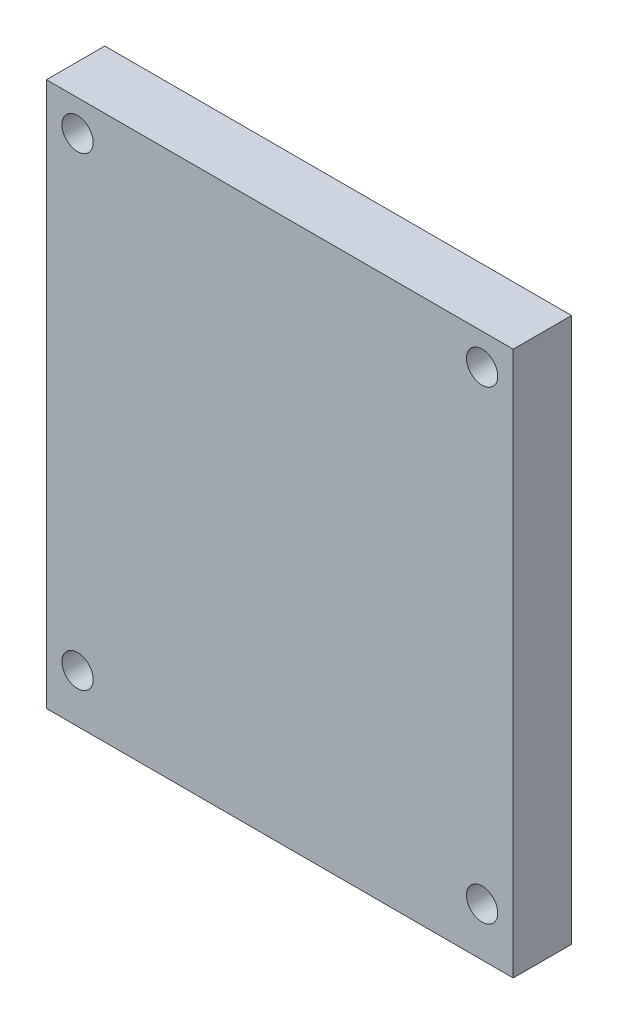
ISO-10303-21;
HEADER;
FILE_DESCRIPTION(('STEP AP214'),'2;1');
FILE_NAME('part.step','',(''),(''),'','','');
FILE_SCHEMA(('AUTOMOTIVE_DESIGN { 1 0 10303 214 1 1 1 1 }'));
ENDSEC;
DATA;
#1=APPLICATION_CONTEXT('core data for automotive mechanical design processes');
#2=APPLICATION_PROTOCOL_DEFINITION('international standard','automotive_design',2000,#1);
#3=PRODUCT_CONTEXT('',#1,'mechanical');
#4=PRODUCT('Part','Part','',(#3));
#5=PRODUCT_RELATED_PRODUCT_CATEGORY('part','',(#4));
#6=PRODUCT_DEFINITION_FORMATION('','',#4);
#7=PRODUCT_DEFINITION_CONTEXT('part definition',#1,'design');
#8=PRODUCT_DEFINITION('design','',#6,#7);
#9=PRODUCT_DEFINITION_SHAPE('','',#8);
#10=(LENGTH_UNIT() NAMED_UNIT(*) SI_UNIT(.MILLI.,.METRE.));
#11=(NAMED_UNIT(*) PLANE_ANGLE_UNIT() SI_UNIT($,.RADIAN.));
#12=(NAMED_UNIT(*) SI_UNIT($,.STERADIAN.) SOLID_ANGLE_UNIT());
#13=UNCERTAINTY_MEASURE_WITH_UNIT(LENGTH_MEASURE(1.E-05),#10,'distance_accuracy_value','');
#14=(GEOMETRIC_REPRESENTATION_CONTEXT(3) GLOBAL_UNCERTAINTY_ASSIGNED_CONTEXT((#13)) GLOBAL_UNIT_ASSIGNED_CONTEXT((#10,
#11,#12)) REPRESENTATION_CONTEXT('',''));
#15=CARTESIAN_POINT('',(0.,0.,0.));
#16=DIRECTION('',(0.,0.,1.));
#17=DIRECTION('',(1.,0.,0.));
#18=AXIS2_PLACEMENT_3D('',#15,#16,#17);
#19=CARTESIAN_POINT('',(0.,0.,9.525));
#20=DIRECTION('',(1.,0.,0.));
#21=DIRECTION('',(0.,0.,-1.));
#22=AXIS2_PLACEMENT_3D('',#19,#20,#21);
#23=PLANE('',#22);
#24=DIRECTION('',(0.,-1.,0.));
#25=VECTOR('',#24,1.);
#26=CARTESIAN_POINT('',(0.,0.,0.));
#27=LINE('',#26,#25);
#28=CARTESIAN_POINT('',(0.,88.9,0.));
#29=VERTEX_POINT('',#28);
#30=CARTESIAN_POINT('',(0.,0.,0.));
#31=VERTEX_POINT('',#30);
#32=EDGE_CURVE('E98',#29,#31,#27,.T.);
#33=ORIENTED_EDGE('',*,*,#32,.T.);
#34=DIRECTION('',(0.,0.,-1.));
#35=VECTOR('',#34,1.);
#36=CARTESIAN_POINT('',(0.,0.,9.525));
#37=LINE('',#36,#35);
#38=CARTESIAN_POINT('',(0.,0.,9.525));
#39=VERTEX_POINT('',#38);
#40=EDGE_CURVE('E11',#39,#31,#37,.T.);
#41=ORIENTED_EDGE('',*,*,#40,.F.);
#42=DIRECTION('',(0.,-1.,0.));
#43=VECTOR('',#42,1.);
#44=CARTESIAN_POINT('',(0.,0.,9.525));
#45=LINE('',#44,#43);
#46=CARTESIAN_POINT('',(0.,88.9,9.525));
#47=VERTEX_POINT('',#46);
#48=EDGE_CURVE('E85',#47,#39,#45,.T.);
#49=ORIENTED_EDGE('',*,*,#48,.F.);
#50=DIRECTION('',(0.,0.,-1.));
#51=VECTOR('',#50,1.);
#52=CARTESIAN_POINT('',(0.,88.9,9.525));
#53=LINE('',#52,#51);
#54=EDGE_CURVE('E94',#47,#29,#53,.T.);
#55=ORIENTED_EDGE('',*,*,#54,.T.);
#56=EDGE_LOOP('',(#33,#41,#49,#55));
#57=FACE_BOUND('',#56,.T.);
#58=ADVANCED_FACE('F32',(#57),#23,.F.);
#59=CARTESIAN_POINT('',(0.,0.,9.525));
#60=DIRECTION('',(0.,1.,0.));
#61=DIRECTION('',(0.,0.,1.));
#62=AXIS2_PLACEMENT_3D('',#59,#60,#61);
#63=PLANE('',#62);
#64=DIRECTION('',(1.,0.,0.));
#65=VECTOR('',#64,1.);
#66=CARTESIAN_POINT('',(0.,0.,0.));
#67=LINE('',#66,#65);
#68=CARTESIAN_POINT('',(76.2,0.,0.));
#69=VERTEX_POINT('',#68);
#70=EDGE_CURVE('E89',#31,#69,#67,.T.);
#71=ORIENTED_EDGE('',*,*,#70,.T.);
#72=DIRECTION('',(0.,0.,-1.));
#73=VECTOR('',#72,1.);
#74=CARTESIAN_POINT('',(76.2,0.,9.525));
#75=LINE('',#74,#73);
#76=CARTESIAN_POINT('',(76.2,0.,9.525));
#77=VERTEX_POINT('',#76);
#78=EDGE_CURVE('E41',#77,#69,#75,.T.);
#79=ORIENTED_EDGE('',*,*,#78,.F.);
#80=DIRECTION('',(1.,0.,0.));
#81=VECTOR('',#80,1.);
#82=CARTESIAN_POINT('',(0.,0.,9.525));
#83=LINE('',#82,#81);
#84=EDGE_CURVE('E80',#39,#77,#83,.T.);
#85=ORIENTED_EDGE('',*,*,#84,.F.);
#86=ORIENTED_EDGE('',*,*,#40,.T.);
#87=EDGE_LOOP('',(#71,#79,#85,#86));
#88=FACE_BOUND('',#87,.T.);
#89=ADVANCED_FACE('F88',(#88),#63,.F.);
#90=CARTESIAN_POINT('',(76.2,0.,9.525));
#91=DIRECTION('',(-1.,0.,0.));
#92=DIRECTION('',(0.,0.,1.));
#93=AXIS2_PLACEMENT_3D('',#90,#91,#92);
#94=PLANE('',#93);
#95=DIRECTION('',(0.,1.,0.));
#96=VECTOR('',#95,1.);
#97=CARTESIAN_POINT('',(76.2,0.,0.));
#98=LINE('',#97,#96);
#99=CARTESIAN_POINT('',(76.2,88.9,0.));
#100=VERTEX_POINT('',#99);
#101=EDGE_CURVE('E67',#69,#100,#98,.T.);
#102=ORIENTED_EDGE('',*,*,#101,.T.);
#103=DIRECTION('',(0.,0.,-1.));
#104=VECTOR('',#103,1.);
#105=CARTESIAN_POINT('',(76.2,88.9,9.525));
#106=LINE('',#105,#104);
#107=CARTESIAN_POINT('',(76.2,88.9,9.525));
#108=VERTEX_POINT('',#107);
#109=EDGE_CURVE('E90',#108,#100,#106,.T.);
#110=ORIENTED_EDGE('',*,*,#109,.F.);
#111=DIRECTION('',(0.,1.,0.));
#112=VECTOR('',#111,1.);
#113=CARTESIAN_POINT('',(76.2,0.,9.525));
#114=LINE('',#113,#112);
#115=EDGE_CURVE('E83',#77,#108,#114,.T.);
#116=ORIENTED_EDGE('',*,*,#115,.F.);
#117=ORIENTED_EDGE('',*,*,#78,.T.);
#118=EDGE_LOOP('',(#102,#110,#116,#117));
#119=FACE_BOUND('',#118,.T.);
#120=ADVANCED_FACE('F92',(#119),#94,.F.);
#121=CARTESIAN_POINT('',(0.,88.9,9.525));
#122=DIRECTION('',(0.,-1.,0.));
#123=DIRECTION('',(0.,0.,-1.));
#124=AXIS2_PLACEMENT_3D('',#121,#122,#123);
#125=PLANE('',#124);
#126=DIRECTION('',(-1.,0.,0.));
#127=VECTOR('',#126,1.);
#128=CARTESIAN_POINT('',(0.,88.9,0.));
#129=LINE('',#128,#127);
#130=EDGE_CURVE('E73',#100,#29,#129,.T.);
#131=ORIENTED_EDGE('',*,*,#130,.T.);
#132=ORIENTED_EDGE('',*,*,#54,.F.);
#133=DIRECTION('',(-1.,0.,0.));
#134=VECTOR('',#133,1.);
#135=CARTESIAN_POINT('',(0.,88.9,9.525));
#136=LINE('',#135,#134);
#137=EDGE_CURVE('E50',#108,#47,#136,.T.);
#138=ORIENTED_EDGE('',*,*,#137,.F.);
#139=ORIENTED_EDGE('',*,*,#109,.T.);
#140=EDGE_LOOP('',(#131,#132,#138,#139));
#141=FACE_BOUND('',#140,.T.);
#142=ADVANCED_FACE('F141',(#141),#125,.F.);
#143=CARTESIAN_POINT('',(0.,0.,9.525));
#144=DIRECTION('',(0.,0.,-1.));
#145=DIRECTION('',(-1.,0.,0.));
#146=AXIS2_PLACEMENT_3D('',#143,#144,#145);
#147=PLANE('',#146);
#148=CARTESIAN_POINT('',(71.12,83.82,9.525));
#149=DIRECTION('',(0.,0.,1.));
#150=DIRECTION('',(1.,0.,0.));
#151=AXIS2_PLACEMENT_3D('',#148,#149,#150);
#152=CIRCLE('',#151,2.55270000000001);
#153=CARTESIAN_POINT('',(73.6727,83.82,9.525));
#154=VERTEX_POINT('',#153);
#155=EDGE_CURVE('E123',#154,#154,#152,.T.);
#156=ORIENTED_EDGE('',*,*,#155,.F.);
#157=EDGE_LOOP('',(#156));
#158=FACE_BOUND('',#157,.T.);
#159=CARTESIAN_POINT('',(5.08,83.82,9.525));
#160=DIRECTION('',(0.,0.,1.));
#161=DIRECTION('',(1.,0.,0.));
#162=AXIS2_PLACEMENT_3D('',#159,#160,#161);
#163=CIRCLE('',#162,2.5527);
#164=CARTESIAN_POINT('',(7.6327,83.82,9.525));
#165=VERTEX_POINT('',#164);
#166=EDGE_CURVE('E113',#165,#165,#163,.T.);
#167=ORIENTED_EDGE('',*,*,#166,.F.);
#168=EDGE_LOOP('',(#167));
#169=FACE_BOUND('',#168,.T.);
#170=CARTESIAN_POINT('',(5.08,7.91210000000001,9.525));
#171=DIRECTION('',(0.,0.,1.));
#172=DIRECTION('',(1.,0.,0.));
#173=AXIS2_PLACEMENT_3D('',#170,#171,#172);
#174=CIRCLE('',#173,2.5527);
#175=CARTESIAN_POINT('',(7.6327,7.91210000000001,9.525));
#176=VERTEX_POINT('',#175);
#177=EDGE_CURVE('E110',#176,#176,#174,.T.);
#178=ORIENTED_EDGE('',*,*,#177,.F.);
#179=EDGE_LOOP('',(#178));
#180=FACE_BOUND('',#179,.T.);
#181=CARTESIAN_POINT('',(71.12,7.91210000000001,9.525));
#182=DIRECTION('',(0.,0.,1.));
#183=DIRECTION('',(1.,0.,0.));
#184=AXIS2_PLACEMENT_3D('',#181,#182,#183);
#185=CIRCLE('',#184,2.55270000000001);
#186=CARTESIAN_POINT('',(73.6727,7.91210000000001,9.525));
#187=VERTEX_POINT('',#186);
#188=EDGE_CURVE('E109',#187,#187,#185,.T.);
#189=ORIENTED_EDGE('',*,*,#188,.F.);
#190=EDGE_LOOP('',(#189));
#191=FACE_BOUND('',#190,.T.);
#192=ORIENTED_EDGE('',*,*,#48,.T.);
#193=ORIENTED_EDGE('',*,*,#84,.T.);
#194=ORIENTED_EDGE('',*,*,#115,.T.);
#195=ORIENTED_EDGE('',*,*,#137,.T.);
#196=EDGE_LOOP('',(#192,#193,#194,#195));
#197=FACE_BOUND('',#196,.T.);
#198=ADVANCED_FACE('F81',(#158,#169,#180,#191,#197),#147,.F.);
#199=CARTESIAN_POINT('',(0.,0.,0.));
#200=DIRECTION('',(0.,0.,-1.));
#201=DIRECTION('',(-1.,0.,0.));
#202=AXIS2_PLACEMENT_3D('',#199,#200,#201);
#203=PLANE('',#202);
#204=CARTESIAN_POINT('',(71.12,83.82,0.));
#205=DIRECTION('',(0.,0.,-1.));
#206=DIRECTION('',(-1.,0.,0.));
#207=AXIS2_PLACEMENT_3D('',#204,#205,#206);
#208=CIRCLE('',#207,2.5527);
#209=CARTESIAN_POINT('',(68.5673,83.82,0.));
#210=VERTEX_POINT('',#209);
#211=EDGE_CURVE('E35',#210,#210,#208,.T.);
#212=ORIENTED_EDGE('',*,*,#211,.F.);
#213=EDGE_LOOP('',(#212));
#214=FACE_BOUND('',#213,.T.);
#215=CARTESIAN_POINT('',(5.08,83.82,0.));
#216=DIRECTION('',(0.,0.,-1.));
#217=DIRECTION('',(-1.,0.,0.));
#218=AXIS2_PLACEMENT_3D('',#215,#216,#217);
#219=CIRCLE('',#218,2.5527);
#220=CARTESIAN_POINT('',(2.5273,83.82,0.));
#221=VERTEX_POINT('',#220);
#222=EDGE_CURVE('E111',#221,#221,#219,.T.);
#223=ORIENTED_EDGE('',*,*,#222,.F.);
#224=EDGE_LOOP('',(#223));
#225=FACE_BOUND('',#224,.T.);
#226=CARTESIAN_POINT('',(5.08,7.91210000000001,0.));
#227=DIRECTION('',(0.,0.,-1.));
#228=DIRECTION('',(-1.,0.,0.));
#229=AXIS2_PLACEMENT_3D('',#226,#227,#228);
#230=CIRCLE('',#229,2.5527);
#231=CARTESIAN_POINT('',(2.5273,7.91210000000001,0.));
#232=VERTEX_POINT('',#231);
#233=EDGE_CURVE('E107',#232,#232,#230,.T.);
#234=ORIENTED_EDGE('',*,*,#233,.F.);
#235=EDGE_LOOP('',(#234));
#236=FACE_BOUND('',#235,.T.);
#237=CARTESIAN_POINT('',(71.12,7.91210000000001,0.));
#238=DIRECTION('',(0.,0.,-1.));
#239=DIRECTION('',(-1.,0.,0.));
#240=AXIS2_PLACEMENT_3D('',#237,#238,#239);
#241=CIRCLE('',#240,2.5527);
#242=CARTESIAN_POINT('',(68.5673,7.91210000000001,0.));
#243=VERTEX_POINT('',#242);
#244=EDGE_CURVE('E101',#243,#243,#241,.T.);
#245=ORIENTED_EDGE('',*,*,#244,.F.);
#246=EDGE_LOOP('',(#245));
#247=FACE_BOUND('',#246,.T.);
#248=ORIENTED_EDGE('',*,*,#32,.F.);
#249=ORIENTED_EDGE('',*,*,#130,.F.);
#250=ORIENTED_EDGE('',*,*,#101,.F.);
#251=ORIENTED_EDGE('',*,*,#70,.F.);
#252=EDGE_LOOP('',(#248,#249,#250,#251));
#253=FACE_BOUND('',#252,.T.);
#254=ADVANCED_FACE('F134',(#214,#225,#236,#247,#253),#203,.T.);
#255=CARTESIAN_POINT('',(71.12,7.91210000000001,9.525));
#256=DIRECTION('',(0.,0.,1.));
#257=DIRECTION('',(1.,0.,0.));
#258=AXIS2_PLACEMENT_3D('',#255,#256,#257);
#259=CYLINDRICAL_SURFACE('',#258,2.5527);
#260=ORIENTED_EDGE('',*,*,#244,.T.);
#261=EDGE_LOOP('',(#260));
#262=FACE_BOUND('',#261,.T.);
#263=ORIENTED_EDGE('',*,*,#188,.T.);
#264=EDGE_LOOP('',(#263));
#265=FACE_BOUND('',#264,.T.);
#266=ADVANCED_FACE('F131',(#262,#265),#259,.F.);
#267=CARTESIAN_POINT('',(5.08,7.91210000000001,9.525));
#268=DIRECTION('',(0.,0.,1.));
#269=DIRECTION('',(1.,0.,0.));
#270=AXIS2_PLACEMENT_3D('',#267,#268,#269);
#271=CYLINDRICAL_SURFACE('',#270,2.5527);
#272=ORIENTED_EDGE('',*,*,#233,.T.);
#273=EDGE_LOOP('',(#272));
#274=FACE_BOUND('',#273,.T.);
#275=ORIENTED_EDGE('',*,*,#177,.T.);
#276=EDGE_LOOP('',(#275));
#277=FACE_BOUND('',#276,.T.);
#278=ADVANCED_FACE('F186',(#274,#277),#271,.F.);
#279=CARTESIAN_POINT('',(5.08,83.82,9.525));
#280=DIRECTION('',(0.,0.,1.));
#281=DIRECTION('',(1.,0.,0.));
#282=AXIS2_PLACEMENT_3D('',#279,#280,#281);
#283=CYLINDRICAL_SURFACE('',#282,2.5527);
#284=ORIENTED_EDGE('',*,*,#222,.T.);
#285=EDGE_LOOP('',(#284));
#286=FACE_BOUND('',#285,.T.);
#287=ORIENTED_EDGE('',*,*,#166,.T.);
#288=EDGE_LOOP('',(#287));
#289=FACE_BOUND('',#288,.T.);
#290=ADVANCED_FACE('F195',(#286,#289),#283,.F.);
#291=CARTESIAN_POINT('',(71.12,83.82,9.525));
#292=DIRECTION('',(0.,0.,1.));
#293=DIRECTION('',(1.,0.,0.));
#294=AXIS2_PLACEMENT_3D('',#291,#292,#293);
#295=CYLINDRICAL_SURFACE('',#294,2.5527);
#296=ORIENTED_EDGE('',*,*,#211,.T.);
#297=EDGE_LOOP('',(#296));
#298=FACE_BOUND('',#297,.T.);
#299=ORIENTED_EDGE('',*,*,#155,.T.);
#300=EDGE_LOOP('',(#299));
#301=FACE_BOUND('',#300,.T.);
#302=ADVANCED_FACE('F205',(#298,#301),#295,.F.);
#303=CLOSED_SHELL('',(#58,#89,#120,#142,#198,#254,#266,#278,#290,#302));
#304=MANIFOLD_SOLID_BREP('B2',#303);
#305=ADVANCED_BREP_SHAPE_REPRESENTATION('',(#18,#304),#14);
#306=SHAPE_DEFINITION_REPRESENTATION(#9,#305);
ENDSEC;
END-ISO-10303-21;
